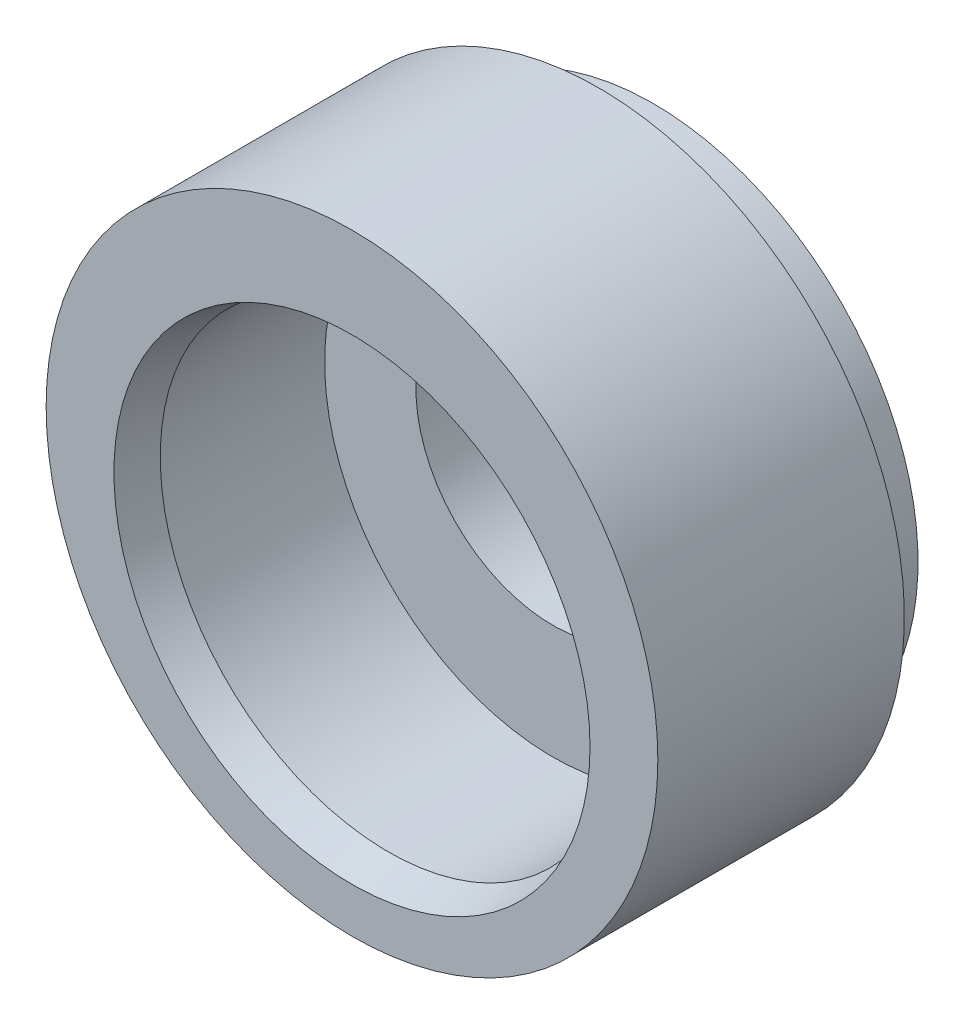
from build123d import *

# Parameters (mm, degrees)
SKETCH1_R          = 8.509
SKETCH1_R_2        = 3.81
BASE_EXTRUDE_DEPTH = 8.382
SKETCH2_R          = 6.35
OFFSET_HOLE_DEPTH  = 5.588
SKETCH3_OUTSIDE_W  = 24.114
SKETCH3_OUTSIDE_H  = 24.114
SKETCH3_OUTSIDE_R  = 7.366
CUT_EXTRUDE2_DEPTH = 1.524
CHAMFER1_SIZE      = 1.016
CHAMFER1_SIZE2     = 0.27223638


with BuildPart() as part:
    # Sketch1 → Base-Extrude (new body)
    with BuildSketch(Plane.XY):
        Circle(SKETCH1_R)
        Circle(SKETCH1_R_2, mode=Mode.SUBTRACT)
    extrude(amount=BASE_EXTRUDE_DEPTH)

    # Sketch2 → offset_hole (cut)
    with BuildSketch(Plane.XY.offset(8.382)):
        with Locations((0, -0.635)):
            Circle(SKETCH2_R)
    extrude(amount=-OFFSET_HOLE_DEPTH, mode=Mode.SUBTRACT)

    # Sketch3 outside → Cut-Extrude2 (cut)
    with BuildSketch(Plane(origin=(0, 0, 0), x_dir=(-1, 0, 0), z_dir=(0, 0, -1))):
        Rectangle(SKETCH3_OUTSIDE_W, SKETCH3_OUTSIDE_H)
        Circle(SKETCH3_OUTSIDE_R, mode=Mode.SUBTRACT)
    extrude(amount=-CUT_EXTRUDE2_DEPTH, mode=Mode.SUBTRACT)

    # Chamfer1
    chamfer1_edges = [part.edges().sort_by_distance(p)[0] for p in [
        (-6.35, -0.635, 8.382),
    ]]
    chamfer1_side = [part.faces().sort_by_distance(p)[0] for p in [
        (-6.35, -0.635, 5.588),
    ]]
    chamfer(chamfer1_edges, length=CHAMFER1_SIZE, length2=CHAMFER1_SIZE2, reference=chamfer1_side[0])


solid = part.part
